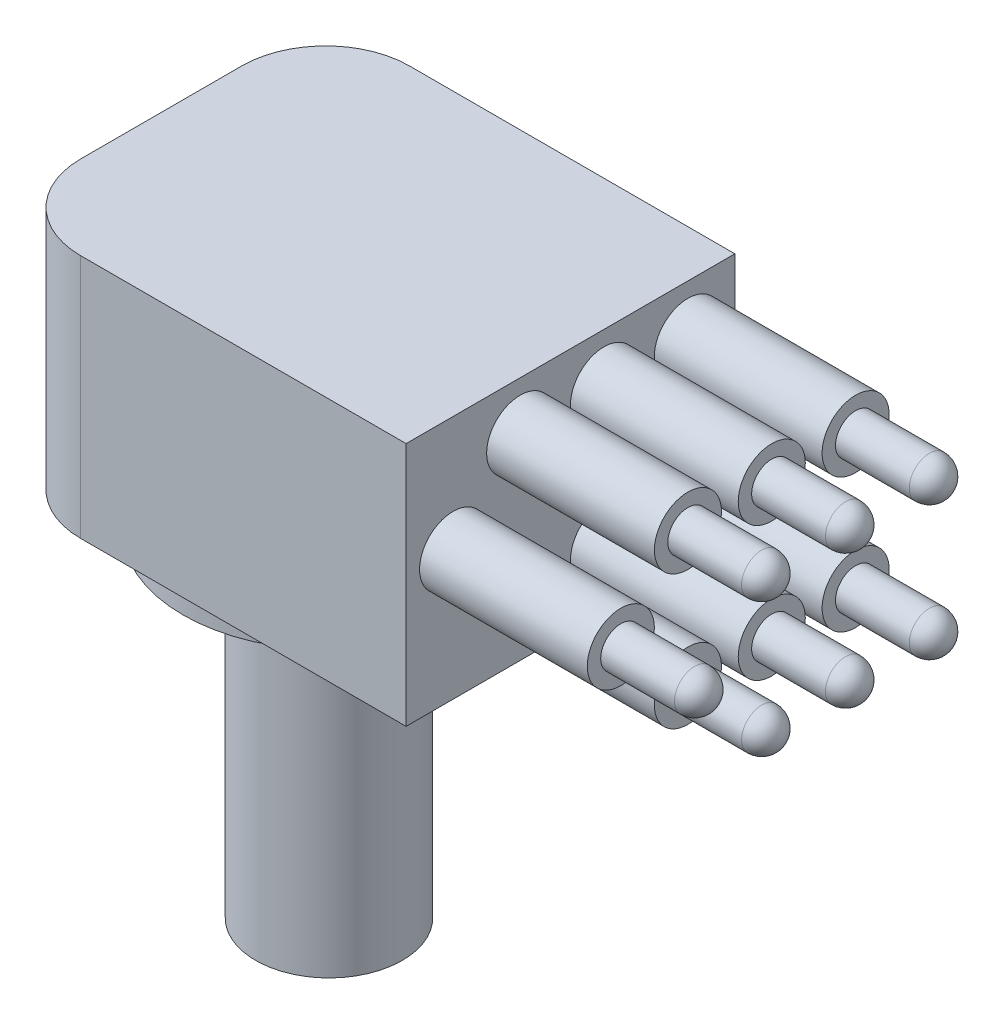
ISO-10303-21;
HEADER;
FILE_DESCRIPTION(('STEP AP214'),'2;1');
FILE_NAME('part.step','',(''),(''),'','','');
FILE_SCHEMA(('AUTOMOTIVE_DESIGN { 1 0 10303 214 1 1 1 1 }'));
ENDSEC;
DATA;
#1=APPLICATION_CONTEXT('core data for automotive mechanical design processes');
#2=APPLICATION_PROTOCOL_DEFINITION('international standard','automotive_design',2000,#1);
#3=PRODUCT_CONTEXT('',#1,'mechanical');
#4=PRODUCT('Part','Part','',(#3));
#5=PRODUCT_RELATED_PRODUCT_CATEGORY('part','',(#4));
#6=PRODUCT_DEFINITION_FORMATION('','',#4);
#7=PRODUCT_DEFINITION_CONTEXT('part definition',#1,'design');
#8=PRODUCT_DEFINITION('design','',#6,#7);
#9=PRODUCT_DEFINITION_SHAPE('','',#8);
#10=(LENGTH_UNIT() NAMED_UNIT(*) SI_UNIT(.MILLI.,.METRE.));
#11=(NAMED_UNIT(*) PLANE_ANGLE_UNIT() SI_UNIT($,.RADIAN.));
#12=(NAMED_UNIT(*) SI_UNIT($,.STERADIAN.) SOLID_ANGLE_UNIT());
#13=UNCERTAINTY_MEASURE_WITH_UNIT(LENGTH_MEASURE(1.E-05),#10,'distance_accuracy_value','');
#14=(GEOMETRIC_REPRESENTATION_CONTEXT(3) GLOBAL_UNCERTAINTY_ASSIGNED_CONTEXT((#13)) GLOBAL_UNIT_ASSIGNED_CONTEXT((#10,
#11,#12)) REPRESENTATION_CONTEXT('',''));
#15=CARTESIAN_POINT('',(0.,0.,0.));
#16=DIRECTION('',(0.,0.,1.));
#17=DIRECTION('',(1.,0.,0.));
#18=AXIS2_PLACEMENT_3D('',#15,#16,#17);
#19=CARTESIAN_POINT('',(43.6880000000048,4.69900000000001,3.55599999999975));
#20=DIRECTION('',(1.,0.,0.));
#21=DIRECTION('',(0.,0.,-1.));
#22=AXIS2_PLACEMENT_3D('',#19,#20,#21);
#23=PLANE('',#22);
#24=CARTESIAN_POINT('',(43.6880000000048,4.69900000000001,3.55599999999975));
#25=DIRECTION('',(1.,0.,0.));
#26=DIRECTION('',(0.,0.,-1.));
#27=AXIS2_PLACEMENT_3D('',#24,#25,#26);
#28=CIRCLE('',#27,2.54);
#29=CARTESIAN_POINT('',(43.6880000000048,4.69900000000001,1.01599999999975));
#30=VERTEX_POINT('',#29);
#31=EDGE_CURVE('E613',#30,#30,#28,.T.);
#32=ORIENTED_EDGE('',*,*,#31,.T.);
#33=EDGE_LOOP('',(#32));
#34=FACE_BOUND('',#33,.T.);
#35=CARTESIAN_POINT('',(43.6880000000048,4.69900000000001,3.55599999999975));
#36=DIRECTION('',(1.,0.,0.));
#37=DIRECTION('',(0.,0.,-1.));
#38=AXIS2_PLACEMENT_3D('',#35,#36,#37);
#39=CIRCLE('',#38,1.524);
#40=CARTESIAN_POINT('',(43.6880000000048,4.69900000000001,2.03199999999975));
#41=VERTEX_POINT('',#40);
#42=EDGE_CURVE('E686',#41,#41,#39,.T.);
#43=ORIENTED_EDGE('',*,*,#42,.F.);
#44=EDGE_LOOP('',(#43));
#45=FACE_BOUND('',#44,.T.);
#46=ADVANCED_FACE('F44',(#34,#45),#23,.T.);
#47=CARTESIAN_POINT('',(43.6880000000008,4.69900000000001,9.90599999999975));
#48=DIRECTION('',(1.,0.,0.));
#49=DIRECTION('',(0.,0.,-1.));
#50=AXIS2_PLACEMENT_3D('',#47,#48,#49);
#51=PLANE('',#50);
#52=CARTESIAN_POINT('',(43.6880000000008,4.69900000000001,9.90599999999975));
#53=DIRECTION('',(1.,0.,0.));
#54=DIRECTION('',(0.,0.,-1.));
#55=AXIS2_PLACEMENT_3D('',#52,#53,#54);
#56=CIRCLE('',#55,2.54);
#57=CARTESIAN_POINT('',(43.6880000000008,4.69900000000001,7.36599999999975));
#58=VERTEX_POINT('',#57);
#59=EDGE_CURVE('E615',#58,#58,#56,.T.);
#60=ORIENTED_EDGE('',*,*,#59,.T.);
#61=EDGE_LOOP('',(#60));
#62=FACE_BOUND('',#61,.T.);
#63=CARTESIAN_POINT('',(43.6880000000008,4.69900000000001,9.90599999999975));
#64=DIRECTION('',(1.,0.,0.));
#65=DIRECTION('',(0.,0.,-1.));
#66=AXIS2_PLACEMENT_3D('',#63,#64,#65);
#67=CIRCLE('',#66,1.524);
#68=CARTESIAN_POINT('',(43.6880000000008,4.69900000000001,8.38199999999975));
#69=VERTEX_POINT('',#68);
#70=EDGE_CURVE('E604',#69,#69,#67,.T.);
#71=ORIENTED_EDGE('',*,*,#70,.F.);
#72=EDGE_LOOP('',(#71));
#73=FACE_BOUND('',#72,.T.);
#74=ADVANCED_FACE('F211',(#62,#73),#51,.T.);
#75=CARTESIAN_POINT('',(43.6880000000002,4.69900000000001,16.2559999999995));
#76=DIRECTION('',(1.,0.,0.));
#77=DIRECTION('',(0.,0.,-1.));
#78=AXIS2_PLACEMENT_3D('',#75,#76,#77);
#79=PLANE('',#78);
#80=CARTESIAN_POINT('',(43.6880000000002,4.69900000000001,16.2559999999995));
#81=DIRECTION('',(1.,0.,0.));
#82=DIRECTION('',(0.,0.,-1.));
#83=AXIS2_PLACEMENT_3D('',#80,#81,#82);
#84=CIRCLE('',#83,2.54);
#85=CARTESIAN_POINT('',(43.6880000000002,4.69900000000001,13.7159999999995));
#86=VERTEX_POINT('',#85);
#87=EDGE_CURVE('E618',#86,#86,#84,.T.);
#88=ORIENTED_EDGE('',*,*,#87,.T.);
#89=EDGE_LOOP('',(#88));
#90=FACE_BOUND('',#89,.T.);
#91=CARTESIAN_POINT('',(43.6880000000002,4.69900000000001,16.2559999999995));
#92=DIRECTION('',(1.,0.,0.));
#93=DIRECTION('',(0.,0.,-1.));
#94=AXIS2_PLACEMENT_3D('',#91,#92,#93);
#95=CIRCLE('',#94,1.524);
#96=CARTESIAN_POINT('',(43.6880000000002,4.69900000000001,14.7319999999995));
#97=VERTEX_POINT('',#96);
#98=EDGE_CURVE('E598',#97,#97,#95,.T.);
#99=ORIENTED_EDGE('',*,*,#98,.F.);
#100=EDGE_LOOP('',(#99));
#101=FACE_BOUND('',#100,.T.);
#102=ADVANCED_FACE('F217',(#90,#101),#79,.T.);
#103=CARTESIAN_POINT('',(43.6880000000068,14.8590000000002,3.55599999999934));
#104=DIRECTION('',(1.,0.,0.));
#105=DIRECTION('',(0.,0.,-1.));
#106=AXIS2_PLACEMENT_3D('',#103,#104,#105);
#107=PLANE('',#106);
#108=CARTESIAN_POINT('',(43.6880000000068,14.8590000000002,3.55599999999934));
#109=DIRECTION('',(1.,0.,0.));
#110=DIRECTION('',(0.,0.,-1.));
#111=AXIS2_PLACEMENT_3D('',#108,#109,#110);
#112=CIRCLE('',#111,2.54);
#113=CARTESIAN_POINT('',(43.6880000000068,14.8590000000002,1.01599999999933));
#114=VERTEX_POINT('',#113);
#115=EDGE_CURVE('E621',#114,#114,#112,.T.);
#116=ORIENTED_EDGE('',*,*,#115,.T.);
#117=EDGE_LOOP('',(#116));
#118=FACE_BOUND('',#117,.T.);
#119=CARTESIAN_POINT('',(43.6880000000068,14.8590000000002,3.55599999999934));
#120=DIRECTION('',(1.,0.,0.));
#121=DIRECTION('',(0.,0.,-1.));
#122=AXIS2_PLACEMENT_3D('',#119,#120,#121);
#123=CIRCLE('',#122,1.524);
#124=CARTESIAN_POINT('',(43.6880000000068,14.8590000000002,2.03199999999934));
#125=VERTEX_POINT('',#124);
#126=EDGE_CURVE('E595',#125,#125,#123,.T.);
#127=ORIENTED_EDGE('',*,*,#126,.F.);
#128=EDGE_LOOP('',(#127));
#129=FACE_BOUND('',#128,.T.);
#130=ADVANCED_FACE('F241',(#118,#129),#107,.T.);
#131=CARTESIAN_POINT('',(43.6880000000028,14.859,9.90599999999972));
#132=DIRECTION('',(1.,0.,0.));
#133=DIRECTION('',(0.,0.,-1.));
#134=AXIS2_PLACEMENT_3D('',#131,#132,#133);
#135=PLANE('',#134);
#136=CARTESIAN_POINT('',(43.6880000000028,14.859,9.90599999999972));
#137=DIRECTION('',(1.,0.,0.));
#138=DIRECTION('',(0.,0.,-1.));
#139=AXIS2_PLACEMENT_3D('',#136,#137,#138);
#140=CIRCLE('',#139,2.54);
#141=CARTESIAN_POINT('',(43.6880000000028,14.859,7.36599999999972));
#142=VERTEX_POINT('',#141);
#143=EDGE_CURVE('E624',#142,#142,#140,.T.);
#144=ORIENTED_EDGE('',*,*,#143,.T.);
#145=EDGE_LOOP('',(#144));
#146=FACE_BOUND('',#145,.T.);
#147=CARTESIAN_POINT('',(43.6880000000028,14.859,9.90599999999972));
#148=DIRECTION('',(1.,0.,0.));
#149=DIRECTION('',(0.,0.,-1.));
#150=AXIS2_PLACEMENT_3D('',#147,#148,#149);
#151=CIRCLE('',#150,1.524);
#152=CARTESIAN_POINT('',(43.6880000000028,14.859,8.38199999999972));
#153=VERTEX_POINT('',#152);
#154=EDGE_CURVE('E597',#153,#153,#151,.T.);
#155=ORIENTED_EDGE('',*,*,#154,.F.);
#156=EDGE_LOOP('',(#155));
#157=FACE_BOUND('',#156,.T.);
#158=ADVANCED_FACE('F245',(#146,#157),#135,.T.);
#159=CARTESIAN_POINT('',(43.6880000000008,14.859,16.2559999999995));
#160=DIRECTION('',(1.,0.,0.));
#161=DIRECTION('',(0.,0.,-1.));
#162=AXIS2_PLACEMENT_3D('',#159,#160,#161);
#163=PLANE('',#162);
#164=CARTESIAN_POINT('',(43.6880000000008,14.859,16.2559999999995));
#165=DIRECTION('',(1.,0.,0.));
#166=DIRECTION('',(0.,0.,-1.));
#167=AXIS2_PLACEMENT_3D('',#164,#165,#166);
#168=CIRCLE('',#167,2.54);
#169=CARTESIAN_POINT('',(43.6880000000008,14.859,13.7159999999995));
#170=VERTEX_POINT('',#169);
#171=EDGE_CURVE('E627',#170,#170,#168,.T.);
#172=ORIENTED_EDGE('',*,*,#171,.T.);
#173=EDGE_LOOP('',(#172));
#174=FACE_BOUND('',#173,.T.);
#175=CARTESIAN_POINT('',(43.6880000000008,14.859,16.2559999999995));
#176=DIRECTION('',(1.,0.,0.));
#177=DIRECTION('',(0.,0.,-1.));
#178=AXIS2_PLACEMENT_3D('',#175,#176,#177);
#179=CIRCLE('',#178,1.524);
#180=CARTESIAN_POINT('',(43.6880000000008,14.859,14.7319999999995));
#181=VERTEX_POINT('',#180);
#182=EDGE_CURVE('E601',#181,#181,#179,.T.);
#183=ORIENTED_EDGE('',*,*,#182,.F.);
#184=EDGE_LOOP('',(#183));
#185=FACE_BOUND('',#184,.T.);
#186=ADVANCED_FACE('F253',(#174,#185),#163,.T.);
#187=CARTESIAN_POINT('',(43.6880000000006,9.77899999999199,21.3359999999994));
#188=DIRECTION('',(1.,0.,0.));
#189=DIRECTION('',(0.,0.,-1.));
#190=AXIS2_PLACEMENT_3D('',#187,#188,#189);
#191=PLANE('',#190);
#192=CARTESIAN_POINT('',(43.6880000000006,9.77899999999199,21.3359999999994));
#193=DIRECTION('',(1.,0.,0.));
#194=DIRECTION('',(0.,0.,-1.));
#195=AXIS2_PLACEMENT_3D('',#192,#193,#194);
#196=CIRCLE('',#195,2.54);
#197=CARTESIAN_POINT('',(43.6880000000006,9.77899999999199,18.7959999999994));
#198=VERTEX_POINT('',#197);
#199=EDGE_CURVE('E630',#198,#198,#196,.T.);
#200=ORIENTED_EDGE('',*,*,#199,.T.);
#201=EDGE_LOOP('',(#200));
#202=FACE_BOUND('',#201,.T.);
#203=CARTESIAN_POINT('',(43.6880000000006,9.77899999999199,21.3359999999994));
#204=DIRECTION('',(1.,0.,0.));
#205=DIRECTION('',(0.,0.,-1.));
#206=AXIS2_PLACEMENT_3D('',#203,#204,#205);
#207=CIRCLE('',#206,1.524);
#208=CARTESIAN_POINT('',(43.6880000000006,9.77899999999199,19.8119999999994));
#209=VERTEX_POINT('',#208);
#210=EDGE_CURVE('E610',#209,#209,#207,.T.);
#211=ORIENTED_EDGE('',*,*,#210,.F.);
#212=EDGE_LOOP('',(#211));
#213=FACE_BOUND('',#212,.T.);
#214=ADVANCED_FACE('F265',(#202,#213),#191,.T.);
#215=CARTESIAN_POINT('',(30.9880000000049,0.,24.8919999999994));
#216=DIRECTION('',(-1.,0.,0.));
#217=DIRECTION('',(0.,0.,1.));
#218=AXIS2_PLACEMENT_3D('',#215,#216,#217);
#219=PLANE('',#218);
#220=CARTESIAN_POINT('',(30.9880000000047,4.699000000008,9.90599999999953));
#221=DIRECTION('',(-1.,0.,0.));
#222=DIRECTION('',(0.,0.,1.));
#223=AXIS2_PLACEMENT_3D('',#220,#221,#222);
#224=CIRCLE('',#223,2.54);
#225=CARTESIAN_POINT('',(30.9880000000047,4.699000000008,12.4459999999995));
#226=VERTEX_POINT('',#225);
#227=EDGE_CURVE('E170',#226,#226,#224,.F.);
#228=ORIENTED_EDGE('',*,*,#227,.F.);
#229=EDGE_LOOP('',(#228));
#230=FACE_BOUND('',#229,.T.);
#231=CARTESIAN_POINT('',(30.9879999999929,14.858999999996,3.55599999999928));
#232=DIRECTION('',(-1.,0.,0.));
#233=DIRECTION('',(0.,0.,1.));
#234=AXIS2_PLACEMENT_3D('',#231,#232,#233);
#235=CIRCLE('',#234,2.54);
#236=CARTESIAN_POINT('',(30.9879999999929,14.858999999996,6.09599999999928));
#237=VERTEX_POINT('',#236);
#238=EDGE_CURVE('E164',#237,#237,#235,.F.);
#239=ORIENTED_EDGE('',*,*,#238,.F.);
#240=EDGE_LOOP('',(#239));
#241=FACE_BOUND('',#240,.T.);
#242=CARTESIAN_POINT('',(30.9880000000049,14.8590000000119,16.2559999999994));
#243=DIRECTION('',(-1.,0.,0.));
#244=DIRECTION('',(0.,0.,1.));
#245=AXIS2_PLACEMENT_3D('',#242,#243,#244);
#246=CIRCLE('',#245,2.54);
#247=CARTESIAN_POINT('',(30.9880000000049,14.8590000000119,18.7959999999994));
#248=VERTEX_POINT('',#247);
#249=EDGE_CURVE('E158',#248,#248,#246,.F.);
#250=ORIENTED_EDGE('',*,*,#249,.F.);
#251=EDGE_LOOP('',(#250));
#252=FACE_BOUND('',#251,.T.);
#253=DIRECTION('',(0.,1.,0.));
#254=VECTOR('',#253,1.);
#255=CARTESIAN_POINT('',(30.9880000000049,-3.99680288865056E-12,-1.94289029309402E-13));
#256=LINE('',#255,#254);
#257=CARTESIAN_POINT('',(30.9880000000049,-3.99680288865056E-12,-1.94289029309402E-13));
#258=VERTEX_POINT('',#257);
#259=CARTESIAN_POINT('',(30.9880000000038,18.5419999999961,-3.88578058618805E-13));
#260=VERTEX_POINT('',#259);
#261=EDGE_CURVE('E109',#258,#260,#256,.T.);
#262=ORIENTED_EDGE('',*,*,#261,.T.);
#263=DIRECTION('',(0.,0.,-1.));
#264=VECTOR('',#263,1.);
#265=CARTESIAN_POINT('',(30.988000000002,18.5420000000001,24.8919999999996));
#266=LINE('',#265,#264);
#267=CARTESIAN_POINT('',(30.988000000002,18.5420000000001,24.8919999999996));
#268=VERTEX_POINT('',#267);
#269=EDGE_CURVE('E119',#268,#260,#266,.T.);
#270=ORIENTED_EDGE('',*,*,#269,.F.);
#271=DIRECTION('',(0.,1.,0.));
#272=VECTOR('',#271,1.);
#273=CARTESIAN_POINT('',(30.9880000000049,0.,24.8919999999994));
#274=LINE('',#273,#272);
#275=CARTESIAN_POINT('',(30.9880000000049,0.,24.8919999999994));
#276=VERTEX_POINT('',#275);
#277=EDGE_CURVE('E117',#276,#268,#274,.T.);
#278=ORIENTED_EDGE('',*,*,#277,.F.);
#279=DIRECTION('',(0.,0.,-1.));
#280=VECTOR('',#279,1.);
#281=CARTESIAN_POINT('',(30.9880000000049,0.,24.8919999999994));
#282=LINE('',#281,#280);
#283=EDGE_CURVE('E104',#276,#258,#282,.T.);
#284=ORIENTED_EDGE('',*,*,#283,.T.);
#285=EDGE_LOOP('',(#262,#270,#278,#284));
#286=FACE_BOUND('',#285,.T.);
#287=CARTESIAN_POINT('',(30.988,9.77899999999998,21.3359999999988));
#288=DIRECTION('',(-1.,0.,0.));
#289=DIRECTION('',(0.,0.,1.));
#290=AXIS2_PLACEMENT_3D('',#287,#288,#289);
#291=CIRCLE('',#290,2.54);
#292=CARTESIAN_POINT('',(30.988,9.77899999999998,23.8759999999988));
#293=VERTEX_POINT('',#292);
#294=EDGE_CURVE('E155',#293,#293,#291,.F.);
#295=ORIENTED_EDGE('',*,*,#294,.F.);
#296=EDGE_LOOP('',(#295));
#297=FACE_BOUND('',#296,.T.);
#298=CARTESIAN_POINT('',(30.98799999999,14.8590000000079,9.9059999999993));
#299=DIRECTION('',(-1.,0.,0.));
#300=DIRECTION('',(0.,0.,1.));
#301=AXIS2_PLACEMENT_3D('',#298,#299,#300);
#302=CIRCLE('',#301,2.54);
#303=CARTESIAN_POINT('',(30.98799999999,14.8590000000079,12.4459999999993));
#304=VERTEX_POINT('',#303);
#305=EDGE_CURVE('E161',#304,#304,#302,.F.);
#306=ORIENTED_EDGE('',*,*,#305,.F.);
#307=EDGE_LOOP('',(#306));
#308=FACE_BOUND('',#307,.T.);
#309=CARTESIAN_POINT('',(30.988000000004,4.699000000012,16.2559999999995));
#310=DIRECTION('',(-1.,0.,0.));
#311=DIRECTION('',(0.,0.,1.));
#312=AXIS2_PLACEMENT_3D('',#309,#310,#311);
#313=CIRCLE('',#312,2.54);
#314=CARTESIAN_POINT('',(30.988000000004,4.699000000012,18.7959999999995));
#315=VERTEX_POINT('',#314);
#316=EDGE_CURVE('E167',#315,#315,#313,.F.);
#317=ORIENTED_EDGE('',*,*,#316,.F.);
#318=EDGE_LOOP('',(#317));
#319=FACE_BOUND('',#318,.T.);
#320=CARTESIAN_POINT('',(30.9879999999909,4.69899999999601,3.55599999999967));
#321=DIRECTION('',(-1.,0.,0.));
#322=DIRECTION('',(0.,0.,1.));
#323=AXIS2_PLACEMENT_3D('',#320,#321,#322);
#324=CIRCLE('',#323,2.54);
#325=CARTESIAN_POINT('',(30.9879999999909,4.69899999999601,6.09599999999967));
#326=VERTEX_POINT('',#325);
#327=EDGE_CURVE('E173',#326,#326,#324,.F.);
#328=ORIENTED_EDGE('',*,*,#327,.F.);
#329=EDGE_LOOP('',(#328));
#330=FACE_BOUND('',#329,.T.);
#331=ADVANCED_FACE('F113',(#230,#241,#252,#286,#297,#308,#319,#330),#219,.F.);
#332=CARTESIAN_POINT('',(12.700000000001,-2.53999999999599,12.4459999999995));
#333=DIRECTION('',(0.,-1.,0.));
#334=DIRECTION('',(0.,0.,-1.));
#335=AXIS2_PLACEMENT_3D('',#332,#333,#334);
#336=PLANE('',#335);
#337=CARTESIAN_POINT('',(12.700000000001,-2.53999999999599,12.4459999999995));
#338=DIRECTION('',(0.,-1.,0.));
#339=DIRECTION('',(0.,0.,-1.));
#340=AXIS2_PLACEMENT_3D('',#337,#338,#339);
#341=CIRCLE('',#340,11.049);
#342=CARTESIAN_POINT('',(12.700000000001,-2.53999999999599,1.39699999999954));
#343=VERTEX_POINT('',#342);
#344=EDGE_CURVE('E110',#343,#343,#341,.T.);
#345=ORIENTED_EDGE('',*,*,#344,.T.);
#346=EDGE_LOOP('',(#345));
#347=FACE_BOUND('',#346,.T.);
#348=CARTESIAN_POINT('',(12.700000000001,-2.53999999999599,12.4459999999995));
#349=DIRECTION('',(0.,-1.,0.));
#350=DIRECTION('',(0.,0.,-1.));
#351=AXIS2_PLACEMENT_3D('',#348,#349,#350);
#352=CIRCLE('',#351,5.55625);
#353=CARTESIAN_POINT('',(12.700000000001,-2.53999999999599,6.88974999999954));
#354=VERTEX_POINT('',#353);
#355=EDGE_CURVE('E633',#354,#354,#352,.T.);
#356=ORIENTED_EDGE('',*,*,#355,.F.);
#357=EDGE_LOOP('',(#356));
#358=FACE_BOUND('',#357,.T.);
#359=ADVANCED_FACE('F290',(#347,#358),#336,.T.);
#360=CARTESIAN_POINT('',(-1.11022302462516E-12,0.,24.8919999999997));
#361=DIRECTION('',(0.,1.,0.));
#362=DIRECTION('',(0.,0.,1.));
#363=AXIS2_PLACEMENT_3D('',#360,#361,#362);
#364=PLANE('',#363);
#365=DIRECTION('',(1.,0.,0.));
#366=VECTOR('',#365,1.);
#367=CARTESIAN_POINT('',(-1.11022302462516E-12,0.,24.8919999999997));
#368=LINE('',#367,#366);
#369=CARTESIAN_POINT('',(6.35000000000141,-3.99680288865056E-12,24.8919999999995));
#370=VERTEX_POINT('',#369);
#371=EDGE_CURVE('E124',#370,#276,#368,.T.);
#372=ORIENTED_EDGE('',*,*,#371,.F.);
#373=CARTESIAN_POINT('',(6.35000000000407,-3.99680288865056E-12,18.5419999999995));
#374=DIRECTION('',(0.,1.,0.));
#375=DIRECTION('',(0.,0.,1.));
#376=AXIS2_PLACEMENT_3D('',#373,#374,#375);
#377=CIRCLE('',#376,6.35);
#378=CARTESIAN_POINT('',(3.99680288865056E-12,0.,18.5419999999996));
#379=VERTEX_POINT('',#378);
#380=EDGE_CURVE('E144',#370,#379,#377,.F.);
#381=ORIENTED_EDGE('',*,*,#380,.T.);
#382=DIRECTION('',(0.,0.,-1.));
#383=VECTOR('',#382,1.);
#384=CARTESIAN_POINT('',(-1.11022302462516E-12,0.,24.8919999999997));
#385=LINE('',#384,#383);
#386=CARTESIAN_POINT('',(-2.22044604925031E-12,7.99360577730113E-12,6.34999999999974));
#387=VERTEX_POINT('',#386);
#388=EDGE_CURVE('E118',#379,#387,#385,.T.);
#389=ORIENTED_EDGE('',*,*,#388,.T.);
#390=CARTESIAN_POINT('',(6.34999999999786,7.99360577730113E-12,6.34999999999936));
#391=DIRECTION('',(0.,1.,0.));
#392=DIRECTION('',(0.,0.,1.));
#393=AXIS2_PLACEMENT_3D('',#390,#391,#392);
#394=CIRCLE('',#393,6.35);
#395=CARTESIAN_POINT('',(6.35000000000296,-7.99360577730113E-12,-3.60822483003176E-13));
#396=VERTEX_POINT('',#395);
#397=EDGE_CURVE('E107',#387,#396,#394,.F.);
#398=ORIENTED_EDGE('',*,*,#397,.T.);
#399=DIRECTION('',(1.,0.,0.));
#400=VECTOR('',#399,1.);
#401=CARTESIAN_POINT('',(0.,0.,0.));
#402=LINE('',#401,#400);
#403=EDGE_CURVE('E99',#396,#258,#402,.T.);
#404=ORIENTED_EDGE('',*,*,#403,.T.);
#405=ORIENTED_EDGE('',*,*,#283,.F.);
#406=EDGE_LOOP('',(#372,#381,#389,#398,#404,#405));
#407=FACE_BOUND('',#406,.T.);
#408=CARTESIAN_POINT('',(12.7000000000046,3.99680288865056E-12,12.4459999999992));
#409=DIRECTION('',(0.,1.,0.));
#410=DIRECTION('',(0.,0.,1.));
#411=AXIS2_PLACEMENT_3D('',#408,#409,#410);
#412=CIRCLE('',#411,11.049);
#413=CARTESIAN_POINT('',(12.7000000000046,3.99680288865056E-12,23.4949999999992));
#414=VERTEX_POINT('',#413);
#415=EDGE_CURVE('E137',#414,#414,#412,.F.);
#416=ORIENTED_EDGE('',*,*,#415,.F.);
#417=EDGE_LOOP('',(#416));
#418=FACE_BOUND('',#417,.T.);
#419=ADVANCED_FACE('F102',(#407,#418),#364,.F.);
#420=CARTESIAN_POINT('',(-1.11022302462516E-12,0.,24.8919999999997));
#421=DIRECTION('',(1.,0.,0.));
#422=DIRECTION('',(0.,0.,-1.));
#423=AXIS2_PLACEMENT_3D('',#420,#421,#422);
#424=PLANE('',#423);
#425=ORIENTED_EDGE('',*,*,#388,.F.);
#426=DIRECTION('',(0.,-1.,0.));
#427=VECTOR('',#426,1.);
#428=CARTESIAN_POINT('',(3.99680288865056E-12,0.,18.5419999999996));
#429=LINE('',#428,#427);
#430=CARTESIAN_POINT('',(-1.11022302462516E-12,18.5420000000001,18.5419999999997));
#431=VERTEX_POINT('',#430);
#432=EDGE_CURVE('E149',#379,#431,#429,.F.);
#433=ORIENTED_EDGE('',*,*,#432,.T.);
#434=DIRECTION('',(0.,0.,-1.));
#435=VECTOR('',#434,1.);
#436=CARTESIAN_POINT('',(-5.10702591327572E-12,18.5420000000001,24.8919999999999));
#437=LINE('',#436,#435);
#438=CARTESIAN_POINT('',(-9.10382880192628E-12,18.5420000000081,6.3499999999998));
#439=VERTEX_POINT('',#438);
#440=EDGE_CURVE('E133',#431,#439,#437,.T.);
#441=ORIENTED_EDGE('',*,*,#440,.T.);
#442=DIRECTION('',(0.,-1.,0.));
#443=VECTOR('',#442,1.);
#444=CARTESIAN_POINT('',(-2.22044604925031E-12,7.99360577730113E-12,6.34999999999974));
#445=LINE('',#444,#443);
#446=EDGE_CURVE('E146',#439,#387,#445,.T.);
#447=ORIENTED_EDGE('',*,*,#446,.T.);
#448=EDGE_LOOP('',(#425,#433,#441,#447));
#449=FACE_BOUND('',#448,.T.);
#450=ADVANCED_FACE('F46',(#449),#424,.F.);
#451=CARTESIAN_POINT('',(-5.10702591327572E-12,18.5420000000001,24.8919999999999));
#452=DIRECTION('',(0.,-1.,0.));
#453=DIRECTION('',(0.,0.,-1.));
#454=AXIS2_PLACEMENT_3D('',#451,#452,#453);
#455=PLANE('',#454);
#456=ORIENTED_EDGE('',*,*,#440,.F.);
#457=CARTESIAN_POINT('',(6.34999999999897,18.5419999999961,18.5419999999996));
#458=DIRECTION('',(0.,-1.,0.));
#459=DIRECTION('',(0.,0.,-1.));
#460=AXIS2_PLACEMENT_3D('',#457,#458,#459);
#461=CIRCLE('',#460,6.35);
#462=CARTESIAN_POINT('',(6.34999999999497,18.5419999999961,24.8919999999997));
#463=VERTEX_POINT('',#462);
#464=EDGE_CURVE('E152',#431,#463,#461,.F.);
#465=ORIENTED_EDGE('',*,*,#464,.T.);
#466=DIRECTION('',(-1.,0.,0.));
#467=VECTOR('',#466,1.);
#468=CARTESIAN_POINT('',(-5.10702591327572E-12,18.5420000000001,24.8919999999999));
#469=LINE('',#468,#467);
#470=EDGE_CURVE('E130',#268,#463,#469,.T.);
#471=ORIENTED_EDGE('',*,*,#470,.F.);
#472=ORIENTED_EDGE('',*,*,#269,.T.);
#473=DIRECTION('',(-1.,0.,0.));
#474=VECTOR('',#473,1.);
#475=CARTESIAN_POINT('',(-4.21884749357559E-12,18.5420000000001,-3.33066907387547E-13));
#476=LINE('',#475,#474);
#477=CARTESIAN_POINT('',(6.34999999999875,18.5419999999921,-4.44089209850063E-13));
#478=VERTEX_POINT('',#477);
#479=EDGE_CURVE('E122',#260,#478,#476,.T.);
#480=ORIENTED_EDGE('',*,*,#479,.T.);
#481=CARTESIAN_POINT('',(6.35000000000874,18.5420000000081,6.34999999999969));
#482=DIRECTION('',(0.,-1.,0.));
#483=DIRECTION('',(0.,0.,-1.));
#484=AXIS2_PLACEMENT_3D('',#481,#482,#483);
#485=CIRCLE('',#484,6.35);
#486=EDGE_CURVE('E66',#478,#439,#485,.F.);
#487=ORIENTED_EDGE('',*,*,#486,.T.);
#488=EDGE_LOOP('',(#456,#465,#471,#472,#480,#487));
#489=FACE_BOUND('',#488,.T.);
#490=ADVANCED_FACE('F302',(#489),#455,.F.);
#491=CARTESIAN_POINT('',(-5.10702591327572E-12,18.5420000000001,24.8919999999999));
#492=DIRECTION('',(0.,0.,-1.));
#493=DIRECTION('',(-1.,0.,0.));
#494=AXIS2_PLACEMENT_3D('',#491,#492,#493);
#495=PLANE('',#494);
#496=ORIENTED_EDGE('',*,*,#470,.T.);
#497=DIRECTION('',(0.,-1.,0.));
#498=VECTOR('',#497,1.);
#499=CARTESIAN_POINT('',(6.34999999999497,18.5419999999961,24.8919999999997));
#500=LINE('',#499,#498);
#501=EDGE_CURVE('E140',#463,#370,#500,.T.);
#502=ORIENTED_EDGE('',*,*,#501,.T.);
#503=ORIENTED_EDGE('',*,*,#371,.T.);
#504=ORIENTED_EDGE('',*,*,#277,.T.);
#505=EDGE_LOOP('',(#496,#502,#503,#504));
#506=FACE_BOUND('',#505,.T.);
#507=ADVANCED_FACE('F299',(#506),#495,.F.);
#508=CARTESIAN_POINT('',(-4.21884749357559E-12,18.5420000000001,-3.33066907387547E-13));
#509=DIRECTION('',(0.,0.,-1.));
#510=DIRECTION('',(-1.,0.,0.));
#511=AXIS2_PLACEMENT_3D('',#508,#509,#510);
#512=PLANE('',#511);
#513=ORIENTED_EDGE('',*,*,#403,.F.);
#514=DIRECTION('',(0.,-1.,0.));
#515=VECTOR('',#514,1.);
#516=CARTESIAN_POINT('',(6.34999999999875,18.5419999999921,-4.44089209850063E-13));
#517=LINE('',#516,#515);
#518=EDGE_CURVE('E59',#396,#478,#517,.F.);
#519=ORIENTED_EDGE('',*,*,#518,.T.);
#520=ORIENTED_EDGE('',*,*,#479,.F.);
#521=ORIENTED_EDGE('',*,*,#261,.F.);
#522=EDGE_LOOP('',(#513,#519,#520,#521));
#523=FACE_BOUND('',#522,.T.);
#524=ADVANCED_FACE('F121',(#523),#512,.T.);
#525=CARTESIAN_POINT('',(12.700000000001,-2.53999999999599,12.4459999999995));
#526=DIRECTION('',(0.,1.,0.));
#527=DIRECTION('',(0.,0.,1.));
#528=AXIS2_PLACEMENT_3D('',#525,#526,#527);
#529=CYLINDRICAL_SURFACE('',#528,11.049);
#530=ORIENTED_EDGE('',*,*,#344,.F.);
#531=EDGE_LOOP('',(#530));
#532=FACE_BOUND('',#531,.T.);
#533=ORIENTED_EDGE('',*,*,#415,.T.);
#534=EDGE_LOOP('',(#533));
#535=FACE_BOUND('',#534,.T.);
#536=ADVANCED_FACE('F288',(#532,#535),#529,.T.);
#537=CARTESIAN_POINT('',(12.7000000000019,-27.9399999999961,12.4459999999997));
#538=DIRECTION('',(0.,1.,0.));
#539=DIRECTION('',(0.,0.,1.));
#540=AXIS2_PLACEMENT_3D('',#537,#538,#539);
#541=CYLINDRICAL_SURFACE('',#540,5.55625);
#542=CARTESIAN_POINT('',(12.7000000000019,-27.9399999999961,12.4459999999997));
#543=DIRECTION('',(0.,-1.,0.));
#544=DIRECTION('',(0.,0.,-1.));
#545=AXIS2_PLACEMENT_3D('',#542,#543,#544);
#546=CIRCLE('',#545,5.55625);
#547=CARTESIAN_POINT('',(12.7000000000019,-27.9399999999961,6.88974999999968));
#548=VERTEX_POINT('',#547);
#549=EDGE_CURVE('E636',#548,#548,#546,.T.);
#550=ORIENTED_EDGE('',*,*,#549,.F.);
#551=EDGE_LOOP('',(#550));
#552=FACE_BOUND('',#551,.T.);
#553=ORIENTED_EDGE('',*,*,#355,.T.);
#554=EDGE_LOOP('',(#553));
#555=FACE_BOUND('',#554,.T.);
#556=ADVANCED_FACE('F284',(#552,#555),#541,.T.);
#557=CARTESIAN_POINT('',(12.7000000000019,-27.9399999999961,12.4459999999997));
#558=DIRECTION('',(0.,-1.,0.));
#559=DIRECTION('',(0.,0.,-1.));
#560=AXIS2_PLACEMENT_3D('',#557,#558,#559);
#561=PLANE('',#560);
#562=ORIENTED_EDGE('',*,*,#549,.T.);
#563=EDGE_LOOP('',(#562));
#564=FACE_BOUND('',#563,.T.);
#565=ADVANCED_FACE('F280',(#564),#561,.T.);
#566=CARTESIAN_POINT('',(6.34999999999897,18.5419999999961,18.5419999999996));
#567=DIRECTION('',(0.,-1.,0.));
#568=DIRECTION('',(0.,0.,-1.));
#569=AXIS2_PLACEMENT_3D('',#566,#567,#568);
#570=CYLINDRICAL_SURFACE('',#569,6.35);
#571=ORIENTED_EDGE('',*,*,#464,.F.);
#572=ORIENTED_EDGE('',*,*,#432,.F.);
#573=ORIENTED_EDGE('',*,*,#380,.F.);
#574=ORIENTED_EDGE('',*,*,#501,.F.);
#575=EDGE_LOOP('',(#571,#572,#573,#574));
#576=FACE_BOUND('',#575,.T.);
#577=ADVANCED_FACE('F276',(#576),#570,.T.);
#578=CARTESIAN_POINT('',(6.34999999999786,7.99360577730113E-12,6.34999999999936));
#579=DIRECTION('',(0.,1.,0.));
#580=DIRECTION('',(0.,0.,1.));
#581=AXIS2_PLACEMENT_3D('',#578,#579,#580);
#582=CYLINDRICAL_SURFACE('',#581,6.35);
#583=ORIENTED_EDGE('',*,*,#486,.F.);
#584=ORIENTED_EDGE('',*,*,#518,.F.);
#585=ORIENTED_EDGE('',*,*,#397,.F.);
#586=ORIENTED_EDGE('',*,*,#446,.F.);
#587=EDGE_LOOP('',(#583,#584,#585,#586));
#588=FACE_BOUND('',#587,.T.);
#589=ADVANCED_FACE('F272',(#588),#582,.T.);
#590=CARTESIAN_POINT('',(43.6880000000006,9.77899999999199,21.3359999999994));
#591=DIRECTION('',(-1.,0.,0.));
#592=DIRECTION('',(0.,0.,1.));
#593=AXIS2_PLACEMENT_3D('',#590,#591,#592);
#594=CYLINDRICAL_SURFACE('',#593,2.54);
#595=ORIENTED_EDGE('',*,*,#199,.F.);
#596=EDGE_LOOP('',(#595));
#597=FACE_BOUND('',#596,.T.);
#598=ORIENTED_EDGE('',*,*,#294,.T.);
#599=EDGE_LOOP('',(#598));
#600=FACE_BOUND('',#599,.T.);
#601=ADVANCED_FACE('F261',(#597,#600),#594,.T.);
#602=CARTESIAN_POINT('',(43.6880000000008,14.859,16.2559999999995));
#603=DIRECTION('',(-1.,0.,0.));
#604=DIRECTION('',(0.,0.,1.));
#605=AXIS2_PLACEMENT_3D('',#602,#603,#604);
#606=CYLINDRICAL_SURFACE('',#605,2.54);
#607=ORIENTED_EDGE('',*,*,#171,.F.);
#608=EDGE_LOOP('',(#607));
#609=FACE_BOUND('',#608,.T.);
#610=ORIENTED_EDGE('',*,*,#249,.T.);
#611=EDGE_LOOP('',(#610));
#612=FACE_BOUND('',#611,.T.);
#613=ADVANCED_FACE('F257',(#609,#612),#606,.T.);
#614=CARTESIAN_POINT('',(43.6880000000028,14.859,9.90599999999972));
#615=DIRECTION('',(-1.,0.,0.));
#616=DIRECTION('',(0.,0.,1.));
#617=AXIS2_PLACEMENT_3D('',#614,#615,#616);
#618=CYLINDRICAL_SURFACE('',#617,2.54);
#619=ORIENTED_EDGE('',*,*,#143,.F.);
#620=EDGE_LOOP('',(#619));
#621=FACE_BOUND('',#620,.T.);
#622=ORIENTED_EDGE('',*,*,#305,.T.);
#623=EDGE_LOOP('',(#622));
#624=FACE_BOUND('',#623,.T.);
#625=ADVANCED_FACE('F249',(#621,#624),#618,.T.);
#626=CARTESIAN_POINT('',(43.6880000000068,14.8590000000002,3.55599999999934));
#627=DIRECTION('',(-1.,0.,0.));
#628=DIRECTION('',(0.,0.,1.));
#629=AXIS2_PLACEMENT_3D('',#626,#627,#628);
#630=CYLINDRICAL_SURFACE('',#629,2.54);
#631=ORIENTED_EDGE('',*,*,#115,.F.);
#632=EDGE_LOOP('',(#631));
#633=FACE_BOUND('',#632,.T.);
#634=ORIENTED_EDGE('',*,*,#238,.T.);
#635=EDGE_LOOP('',(#634));
#636=FACE_BOUND('',#635,.T.);
#637=ADVANCED_FACE('F237',(#633,#636),#630,.T.);
#638=CARTESIAN_POINT('',(43.6880000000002,4.69900000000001,16.2559999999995));
#639=DIRECTION('',(-1.,0.,0.));
#640=DIRECTION('',(0.,0.,1.));
#641=AXIS2_PLACEMENT_3D('',#638,#639,#640);
#642=CYLINDRICAL_SURFACE('',#641,2.54);
#643=ORIENTED_EDGE('',*,*,#87,.F.);
#644=EDGE_LOOP('',(#643));
#645=FACE_BOUND('',#644,.T.);
#646=ORIENTED_EDGE('',*,*,#316,.T.);
#647=EDGE_LOOP('',(#646));
#648=FACE_BOUND('',#647,.T.);
#649=ADVANCED_FACE('F233',(#645,#648),#642,.T.);
#650=CARTESIAN_POINT('',(43.6880000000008,4.69900000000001,9.90599999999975));
#651=DIRECTION('',(-1.,0.,0.));
#652=DIRECTION('',(0.,0.,1.));
#653=AXIS2_PLACEMENT_3D('',#650,#651,#652);
#654=CYLINDRICAL_SURFACE('',#653,2.54);
#655=ORIENTED_EDGE('',*,*,#59,.F.);
#656=EDGE_LOOP('',(#655));
#657=FACE_BOUND('',#656,.T.);
#658=ORIENTED_EDGE('',*,*,#227,.T.);
#659=EDGE_LOOP('',(#658));
#660=FACE_BOUND('',#659,.T.);
#661=ADVANCED_FACE('F228',(#657,#660),#654,.T.);
#662=CARTESIAN_POINT('',(43.6880000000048,4.69900000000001,3.55599999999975));
#663=DIRECTION('',(-1.,0.,0.));
#664=DIRECTION('',(0.,0.,1.));
#665=AXIS2_PLACEMENT_3D('',#662,#663,#664);
#666=CYLINDRICAL_SURFACE('',#665,2.54);
#667=ORIENTED_EDGE('',*,*,#31,.F.);
#668=EDGE_LOOP('',(#667));
#669=FACE_BOUND('',#668,.T.);
#670=ORIENTED_EDGE('',*,*,#327,.T.);
#671=EDGE_LOOP('',(#670));
#672=FACE_BOUND('',#671,.T.);
#673=ADVANCED_FACE('F226',(#669,#672),#666,.T.);
#674=CARTESIAN_POINT('',(50.8000000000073,9.77899999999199,21.3359999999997));
#675=DIRECTION('',(-1.,0.,0.));
#676=DIRECTION('',(0.,0.,1.));
#677=AXIS2_PLACEMENT_3D('',#674,#675,#676);
#678=CYLINDRICAL_SURFACE('',#677,1.524);
#679=CARTESIAN_POINT('',(49.2760000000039,9.77900000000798,21.3359999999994));
#680=DIRECTION('',(-1.,0.,0.));
#681=DIRECTION('',(0.,0.,1.));
#682=AXIS2_PLACEMENT_3D('',#679,#680,#681);
#683=CIRCLE('',#682,1.524);
#684=CARTESIAN_POINT('',(49.2760000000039,9.77900000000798,22.8599999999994));
#685=VERTEX_POINT('',#684);
#686=EDGE_CURVE('E176',#685,#685,#683,.T.);
#687=ORIENTED_EDGE('',*,*,#686,.T.);
#688=EDGE_LOOP('',(#687));
#689=FACE_BOUND('',#688,.T.);
#690=ORIENTED_EDGE('',*,*,#210,.T.);
#691=EDGE_LOOP('',(#690));
#692=FACE_BOUND('',#691,.T.);
#693=ADVANCED_FACE('F224',(#689,#692),#678,.T.);
#694=CARTESIAN_POINT('',(50.800000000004,14.859,16.2559999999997));
#695=DIRECTION('',(-1.,0.,0.));
#696=DIRECTION('',(0.,0.,1.));
#697=AXIS2_PLACEMENT_3D('',#694,#695,#696);
#698=CYLINDRICAL_SURFACE('',#697,1.524);
#699=CARTESIAN_POINT('',(49.275999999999,14.8590000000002,16.2559999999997));
#700=DIRECTION('',(-1.,0.,0.));
#701=DIRECTION('',(0.,0.,1.));
#702=AXIS2_PLACEMENT_3D('',#699,#700,#701);
#703=CIRCLE('',#702,1.524);
#704=CARTESIAN_POINT('',(49.275999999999,14.8590000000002,17.7799999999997));
#705=VERTEX_POINT('',#704);
#706=EDGE_CURVE('E179',#705,#705,#703,.T.);
#707=ORIENTED_EDGE('',*,*,#706,.T.);
#708=EDGE_LOOP('',(#707));
#709=FACE_BOUND('',#708,.T.);
#710=ORIENTED_EDGE('',*,*,#182,.T.);
#711=EDGE_LOOP('',(#710));
#712=FACE_BOUND('',#711,.T.);
#713=ADVANCED_FACE('F387',(#709,#712),#698,.T.);
#714=CARTESIAN_POINT('',(50.8000000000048,14.859,9.90599999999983));
#715=DIRECTION('',(-1.,0.,0.));
#716=DIRECTION('',(0.,0.,1.));
#717=AXIS2_PLACEMENT_3D('',#714,#715,#716);
#718=CYLINDRICAL_SURFACE('',#717,1.524);
#719=CARTESIAN_POINT('',(49.2760000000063,14.8590000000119,9.90599999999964));
#720=DIRECTION('',(-1.,0.,0.));
#721=DIRECTION('',(0.,0.,1.));
#722=AXIS2_PLACEMENT_3D('',#719,#720,#721);
#723=CIRCLE('',#722,1.524);
#724=CARTESIAN_POINT('',(49.2760000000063,14.8590000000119,11.4299999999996));
#725=VERTEX_POINT('',#724);
#726=EDGE_CURVE('E182',#725,#725,#723,.T.);
#727=ORIENTED_EDGE('',*,*,#726,.T.);
#728=EDGE_LOOP('',(#727));
#729=FACE_BOUND('',#728,.T.);
#730=ORIENTED_EDGE('',*,*,#154,.T.);
#731=EDGE_LOOP('',(#730));
#732=FACE_BOUND('',#731,.T.);
#733=ADVANCED_FACE('F394',(#729,#732),#718,.T.);
#734=CARTESIAN_POINT('',(50.7999999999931,14.8590000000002,3.55599999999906));
#735=DIRECTION('',(-1.,0.,0.));
#736=DIRECTION('',(0.,0.,1.));
#737=AXIS2_PLACEMENT_3D('',#734,#735,#736);
#738=CYLINDRICAL_SURFACE('',#737,1.524);
#739=CARTESIAN_POINT('',(49.2760000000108,14.8590000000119,3.55599999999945));
#740=DIRECTION('',(-1.,0.,0.));
#741=DIRECTION('',(0.,0.,1.));
#742=AXIS2_PLACEMENT_3D('',#739,#740,#741);
#743=CIRCLE('',#742,1.524);
#744=CARTESIAN_POINT('',(49.2760000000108,14.8590000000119,5.07999999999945));
#745=VERTEX_POINT('',#744);
#746=EDGE_CURVE('E185',#745,#745,#743,.T.);
#747=ORIENTED_EDGE('',*,*,#746,.T.);
#748=EDGE_LOOP('',(#747));
#749=FACE_BOUND('',#748,.T.);
#750=ORIENTED_EDGE('',*,*,#126,.T.);
#751=EDGE_LOOP('',(#750));
#752=FACE_BOUND('',#751,.T.);
#753=ADVANCED_FACE('F401',(#749,#752),#738,.T.);
#754=CARTESIAN_POINT('',(50.800000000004,4.69900000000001,16.2559999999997));
#755=DIRECTION('',(-1.,0.,0.));
#756=DIRECTION('',(0.,0.,1.));
#757=AXIS2_PLACEMENT_3D('',#754,#755,#756);
#758=CYLINDRICAL_SURFACE('',#757,1.524);
#759=CARTESIAN_POINT('',(49.2759999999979,4.69900000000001,16.2559999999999));
#760=DIRECTION('',(-1.,0.,0.));
#761=DIRECTION('',(0.,0.,1.));
#762=AXIS2_PLACEMENT_3D('',#759,#760,#761);
#763=CIRCLE('',#762,1.524);
#764=CARTESIAN_POINT('',(49.2759999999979,4.69900000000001,17.7799999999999));
#765=VERTEX_POINT('',#764);
#766=EDGE_CURVE('E13',#765,#765,#763,.T.);
#767=ORIENTED_EDGE('',*,*,#766,.T.);
#768=EDGE_LOOP('',(#767));
#769=FACE_BOUND('',#768,.T.);
#770=ORIENTED_EDGE('',*,*,#98,.T.);
#771=EDGE_LOOP('',(#770));
#772=FACE_BOUND('',#771,.T.);
#773=ADVANCED_FACE('F409',(#769,#772),#758,.T.);
#774=CARTESIAN_POINT('',(50.8000000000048,4.69900000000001,9.90600000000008));
#775=DIRECTION('',(-1.,0.,0.));
#776=DIRECTION('',(0.,0.,1.));
#777=AXIS2_PLACEMENT_3D('',#774,#775,#776);
#778=CYLINDRICAL_SURFACE('',#777,1.524);
#779=CARTESIAN_POINT('',(49.276000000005,4.69900000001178,9.90599999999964));
#780=DIRECTION('',(-1.,0.,0.));
#781=DIRECTION('',(0.,0.,1.));
#782=AXIS2_PLACEMENT_3D('',#779,#780,#781);
#783=CIRCLE('',#782,1.524);
#784=CARTESIAN_POINT('',(49.276000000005,4.69900000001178,11.4299999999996));
#785=VERTEX_POINT('',#784);
#786=EDGE_CURVE('E52',#785,#785,#783,.T.);
#787=ORIENTED_EDGE('',*,*,#786,.T.);
#788=EDGE_LOOP('',(#787));
#789=FACE_BOUND('',#788,.T.);
#790=ORIENTED_EDGE('',*,*,#70,.T.);
#791=EDGE_LOOP('',(#790));
#792=FACE_BOUND('',#791,.T.);
#793=ADVANCED_FACE('F193',(#789,#792),#778,.T.);
#794=CARTESIAN_POINT('',(50.7999999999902,4.69900000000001,3.55599999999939));
#795=DIRECTION('',(-1.,0.,0.));
#796=DIRECTION('',(0.,0.,1.));
#797=AXIS2_PLACEMENT_3D('',#794,#795,#796);
#798=CYLINDRICAL_SURFACE('',#797,1.524);
#799=CARTESIAN_POINT('',(49.2760000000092,4.699000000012,3.55599999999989));
#800=DIRECTION('',(-1.,0.,0.));
#801=DIRECTION('',(0.,0.,1.));
#802=AXIS2_PLACEMENT_3D('',#799,#800,#801);
#803=CIRCLE('',#802,1.524);
#804=CARTESIAN_POINT('',(49.2760000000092,4.699000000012,5.07999999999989));
#805=VERTEX_POINT('',#804);
#806=EDGE_CURVE('E188',#805,#805,#803,.T.);
#807=ORIENTED_EDGE('',*,*,#806,.T.);
#808=EDGE_LOOP('',(#807));
#809=FACE_BOUND('',#808,.T.);
#810=ORIENTED_EDGE('',*,*,#42,.T.);
#811=EDGE_LOOP('',(#810));
#812=FACE_BOUND('',#811,.T.);
#813=ADVANCED_FACE('F424',(#809,#812),#798,.T.);
#814=CARTESIAN_POINT('',(49.2760000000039,9.77900000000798,21.3359999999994));
#815=DIRECTION('',(0.,0.,1.));
#816=DIRECTION('',(1.,0.,0.));
#817=AXIS2_PLACEMENT_3D('',#814,#815,#816);
#818=SPHERICAL_SURFACE('',#817,1.524);
#819=CARTESIAN_POINT('',(49.2760000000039,9.77900000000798,21.3359999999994));
#820=DIRECTION('',(-1.,0.,0.));
#821=DIRECTION('',(0.,0.,1.));
#822=AXIS2_PLACEMENT_3D('',#819,#820,#821);
#823=SPHERICAL_SURFACE('',#822,1.524);
#824=ORIENTED_EDGE('',*,*,#686,.F.);
#825=EDGE_LOOP('',(#824));
#826=FACE_BOUND('',#825,.T.);
#827=ADVANCED_FACE('F431',(#826),#823,.T.);
#828=CARTESIAN_POINT('',(49.275999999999,14.8590000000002,16.2559999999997));
#829=DIRECTION('',(0.,0.,1.));
#830=DIRECTION('',(1.,0.,0.));
#831=AXIS2_PLACEMENT_3D('',#828,#829,#830);
#832=SPHERICAL_SURFACE('',#831,1.524);
#833=CARTESIAN_POINT('',(49.275999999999,14.8590000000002,16.2559999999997));
#834=DIRECTION('',(-1.,0.,0.));
#835=DIRECTION('',(0.,0.,1.));
#836=AXIS2_PLACEMENT_3D('',#833,#834,#835);
#837=SPHERICAL_SURFACE('',#836,1.524);
#838=ORIENTED_EDGE('',*,*,#706,.F.);
#839=EDGE_LOOP('',(#838));
#840=FACE_BOUND('',#839,.T.);
#841=ADVANCED_FACE('F439',(#840),#837,.T.);
#842=CARTESIAN_POINT('',(49.2760000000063,14.8590000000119,9.90599999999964));
#843=DIRECTION('',(0.,0.,1.));
#844=DIRECTION('',(1.,0.,0.));
#845=AXIS2_PLACEMENT_3D('',#842,#843,#844);
#846=SPHERICAL_SURFACE('',#845,1.524);
#847=CARTESIAN_POINT('',(49.2760000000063,14.8590000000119,9.90599999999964));
#848=DIRECTION('',(-1.,0.,0.));
#849=DIRECTION('',(0.,0.,1.));
#850=AXIS2_PLACEMENT_3D('',#847,#848,#849);
#851=SPHERICAL_SURFACE('',#850,1.524);
#852=ORIENTED_EDGE('',*,*,#726,.F.);
#853=EDGE_LOOP('',(#852));
#854=FACE_BOUND('',#853,.T.);
#855=ADVANCED_FACE('F447',(#854),#851,.T.);
#856=CARTESIAN_POINT('',(49.2760000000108,14.8590000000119,3.55599999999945));
#857=DIRECTION('',(0.,0.,1.));
#858=DIRECTION('',(1.,0.,0.));
#859=AXIS2_PLACEMENT_3D('',#856,#857,#858);
#860=SPHERICAL_SURFACE('',#859,1.524);
#861=CARTESIAN_POINT('',(49.2760000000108,14.8590000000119,3.55599999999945));
#862=DIRECTION('',(-1.,0.,0.));
#863=DIRECTION('',(0.,0.,1.));
#864=AXIS2_PLACEMENT_3D('',#861,#862,#863);
#865=SPHERICAL_SURFACE('',#864,1.524);
#866=ORIENTED_EDGE('',*,*,#746,.F.);
#867=EDGE_LOOP('',(#866));
#868=FACE_BOUND('',#867,.T.);
#869=ADVANCED_FACE('F207',(#868),#865,.T.);
#870=CARTESIAN_POINT('',(49.2760000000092,4.699000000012,3.55599999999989));
#871=DIRECTION('',(0.,0.,1.));
#872=DIRECTION('',(1.,0.,0.));
#873=AXIS2_PLACEMENT_3D('',#870,#871,#872);
#874=SPHERICAL_SURFACE('',#873,1.524);
#875=CARTESIAN_POINT('',(49.2760000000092,4.699000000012,3.55599999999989));
#876=DIRECTION('',(-1.,0.,0.));
#877=DIRECTION('',(0.,0.,1.));
#878=AXIS2_PLACEMENT_3D('',#875,#876,#877);
#879=SPHERICAL_SURFACE('',#878,1.524);
#880=ORIENTED_EDGE('',*,*,#806,.F.);
#881=EDGE_LOOP('',(#880));
#882=FACE_BOUND('',#881,.T.);
#883=ADVANCED_FACE('F199',(#882),#879,.T.);
#884=CARTESIAN_POINT('',(49.276000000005,4.69900000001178,9.90599999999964));
#885=DIRECTION('',(0.,0.,1.));
#886=DIRECTION('',(1.,0.,0.));
#887=AXIS2_PLACEMENT_3D('',#884,#885,#886);
#888=SPHERICAL_SURFACE('',#887,1.524);
#889=CARTESIAN_POINT('',(49.276000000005,4.69900000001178,9.90599999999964));
#890=DIRECTION('',(-1.,0.,0.));
#891=DIRECTION('',(0.,0.,1.));
#892=AXIS2_PLACEMENT_3D('',#889,#890,#891);
#893=SPHERICAL_SURFACE('',#892,1.524);
#894=ORIENTED_EDGE('',*,*,#786,.F.);
#895=EDGE_LOOP('',(#894));
#896=FACE_BOUND('',#895,.T.);
#897=ADVANCED_FACE('F196',(#896),#893,.T.);
#898=CARTESIAN_POINT('',(49.2759999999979,4.69900000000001,16.2559999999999));
#899=DIRECTION('',(0.,0.,1.));
#900=DIRECTION('',(1.,0.,0.));
#901=AXIS2_PLACEMENT_3D('',#898,#899,#900);
#902=SPHERICAL_SURFACE('',#901,1.524);
#903=CARTESIAN_POINT('',(49.2759999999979,4.69900000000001,16.2559999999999));
#904=DIRECTION('',(-1.,0.,0.));
#905=DIRECTION('',(0.,0.,1.));
#906=AXIS2_PLACEMENT_3D('',#903,#904,#905);
#907=SPHERICAL_SURFACE('',#906,1.524);
#908=ORIENTED_EDGE('',*,*,#766,.F.);
#909=EDGE_LOOP('',(#908));
#910=FACE_BOUND('',#909,.T.);
#911=ADVANCED_FACE('F198',(#910),#907,.T.);
#912=CLOSED_SHELL('',(#46,#74,#102,#130,#158,#186,#214,#331,#359,#419,#450,#490,#507,#524,#536,
#556,#565,#577,#589,#601,#613,#625,#637,#649,#661,#673,#693,#713,#733,#753,#773,#793,#813,#827,
#841,#855,#869,#883,#897,#911));
#913=MANIFOLD_SOLID_BREP('B2',#912);
#914=ADVANCED_BREP_SHAPE_REPRESENTATION('',(#18,#913),#14);
#915=SHAPE_DEFINITION_REPRESENTATION(#9,#914);
ENDSEC;
END-ISO-10303-21;
